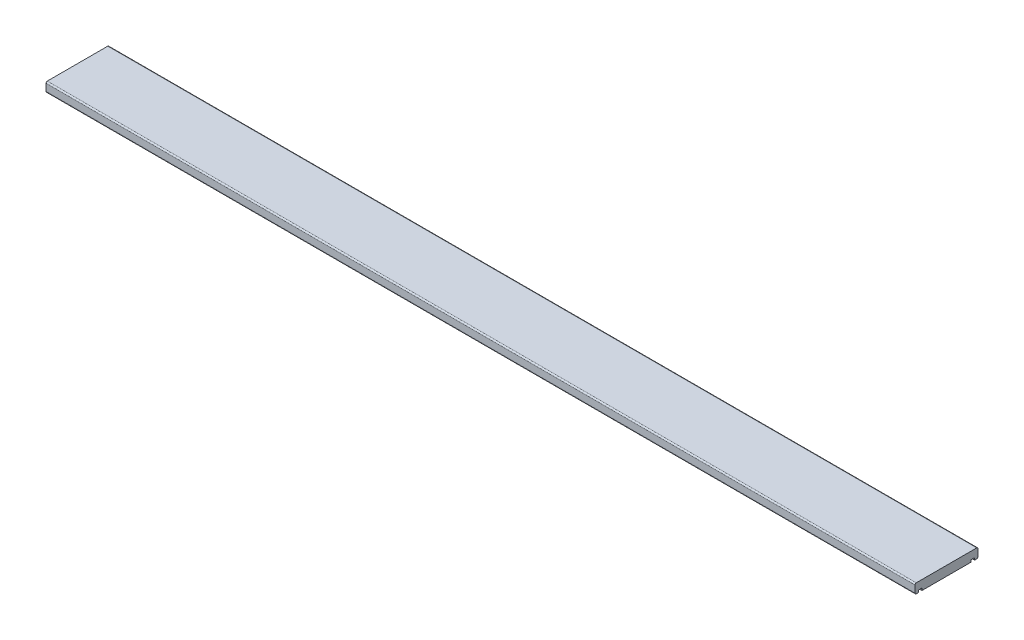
from build123d import *

# Parameters (mm, degrees)
EXTRUDE_L_NGD_DEPTH             = 1000
EXTRUDE_L_NGD_DEPTH_BACK        = 1000
SKETCH1_W                       = 145
SKETCH1_H                       = 22
CUT_DROPPSP_R_REACH             = 1005.168
SKETCH3_W                       = 5
SKETCH3_H                       = 8
CUT_DROPPSP_R_DIRECTION_2_REACH = 1005.168
FILLET_KANTER_R                 = 3


with BuildPart() as part:
    # Sketch1 → Extrude l_ngd (new, two sides: drawn at the far end of the back side and taken through both)
    with BuildSketch(Plane(origin=(0, 0, 0), x_dir=(0, 0, -1), z_dir=(1, 0, 0)).offset(-EXTRUDE_L_NGD_DEPTH_BACK)):
        with Locations((0, 11)):
            Rectangle(SKETCH1_W, SKETCH1_H)
    extrude(amount=EXTRUDE_L_NGD_DEPTH + EXTRUDE_L_NGD_DEPTH_BACK)

    # Sketch3 → Cut droppsp_r (cut, up to next)
    with BuildSketch(Plane(origin=(0, -11, 0), x_dir=(0, -1, 0), z_dir=(-1, 0, 0)), mode=Mode.PRIVATE) as cut_droppsp_r_sk1:
        with Locations((-13.5, -60.5)):
            Rectangle(SKETCH3_W, SKETCH3_H)
    cut_droppsp_r_tool1 = extrude(cut_droppsp_r_sk1.sketch, amount=-CUT_DROPPSP_R_REACH, mode=Mode.PRIVATE) & part.part
    # Sketch3 → Cut droppsp_r (cut, up to next)
    with BuildSketch(Plane(origin=(0, -11, 0), x_dir=(0, -1, 0), z_dir=(-1, 0, 0)), mode=Mode.PRIVATE) as cut_droppsp_r_sk2:
        with Locations((-13.5, 60.5)):
            Rectangle(SKETCH3_W, SKETCH3_H)
    cut_droppsp_r_tool2 = extrude(cut_droppsp_r_sk2.sketch, amount=-CUT_DROPPSP_R_REACH, mode=Mode.PRIVATE) & part.part
    add(cut_droppsp_r_tool1.solids().sort_by_distance((0, 2.5, -60.5))[0], mode=Mode.SUBTRACT)
    add(cut_droppsp_r_tool2.solids().sort_by_distance((0, 2.5, 60.5))[0], mode=Mode.SUBTRACT)

    # Sketch3 → Cut droppsp_r direction 2 (cut, up to next)
    with BuildSketch(Plane(origin=(0, -11, 0), x_dir=(0, -1, 0), z_dir=(-1, 0, 0)), mode=Mode.PRIVATE) as cut_droppsp_r_direction_2_sk1:
        with Locations((-13.5, -60.5)):
            Rectangle(SKETCH3_W, SKETCH3_H)
    cut_droppsp_r_direction_2_tool1 = extrude(cut_droppsp_r_direction_2_sk1.sketch, amount=CUT_DROPPSP_R_DIRECTION_2_REACH, mode=Mode.PRIVATE) & part.part
    # Sketch3 → Cut droppsp_r direction 2 (cut, up to next)
    with BuildSketch(Plane(origin=(0, -11, 0), x_dir=(0, -1, 0), z_dir=(-1, 0, 0)), mode=Mode.PRIVATE) as cut_droppsp_r_direction_2_sk2:
        with Locations((-13.5, 60.5)):
            Rectangle(SKETCH3_W, SKETCH3_H)
    cut_droppsp_r_direction_2_tool2 = extrude(cut_droppsp_r_direction_2_sk2.sketch, amount=CUT_DROPPSP_R_DIRECTION_2_REACH, mode=Mode.PRIVATE) & part.part
    add(cut_droppsp_r_direction_2_tool1.solids().sort_by_distance((0, 2.5, -60.5))[0], mode=Mode.SUBTRACT)
    add(cut_droppsp_r_direction_2_tool2.solids().sort_by_distance((0, 2.5, 60.5))[0], mode=Mode.SUBTRACT)

    # Fillet kanter
    fillet_kanter_edges = [part.edges().sort_by_distance(p)[0] for p in [
        (0, 22, -72.5),
        (0, 0, -72.5),
        (0, 0, 72.5),
        (0, 22, 72.5),
    ]]
    fillet(fillet_kanter_edges, radius=FILLET_KANTER_R)


solid = part.part
